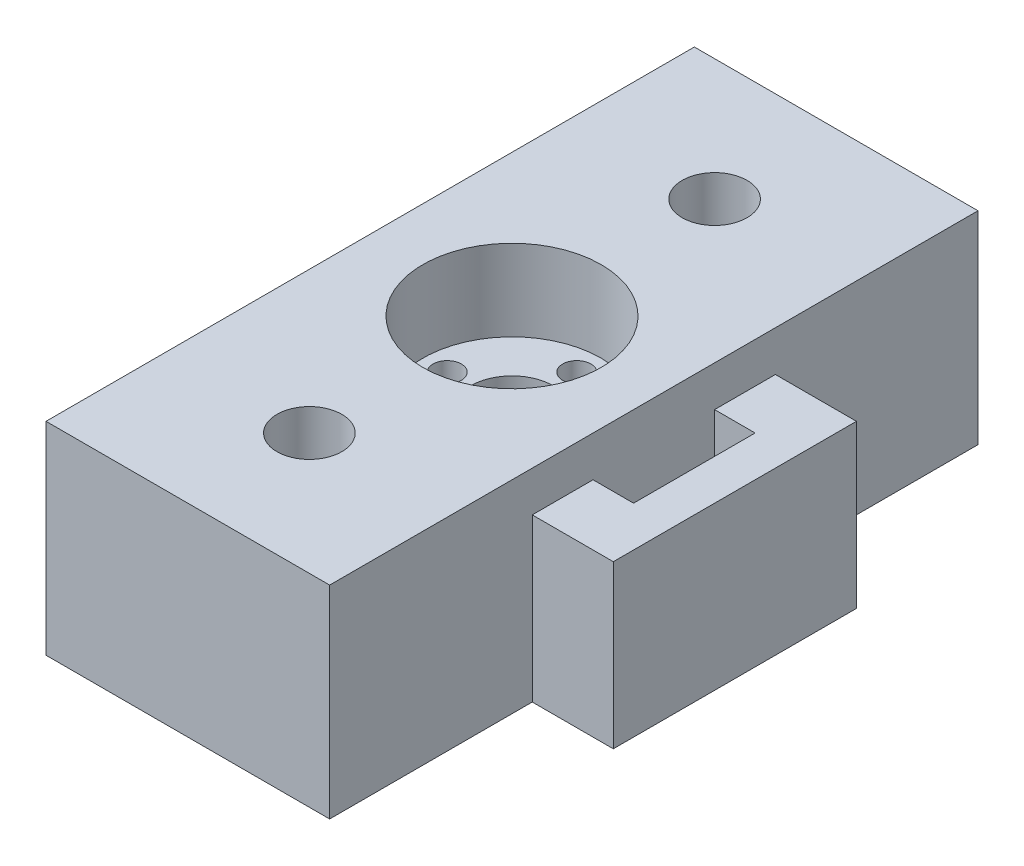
ISO-10303-21;
HEADER;
FILE_DESCRIPTION(('STEP AP214'),'2;1');
FILE_NAME('part.step','',(''),(''),'','','');
FILE_SCHEMA(('AUTOMOTIVE_DESIGN { 1 0 10303 214 1 1 1 1 }'));
ENDSEC;
DATA;
#1=APPLICATION_CONTEXT('core data for automotive mechanical design processes');
#2=APPLICATION_PROTOCOL_DEFINITION('international standard','automotive_design',2000,#1);
#3=PRODUCT_CONTEXT('',#1,'mechanical');
#4=PRODUCT('Part','Part','',(#3));
#5=PRODUCT_RELATED_PRODUCT_CATEGORY('part','',(#4));
#6=PRODUCT_DEFINITION_FORMATION('','',#4);
#7=PRODUCT_DEFINITION_CONTEXT('part definition',#1,'design');
#8=PRODUCT_DEFINITION('design','',#6,#7);
#9=PRODUCT_DEFINITION_SHAPE('','',#8);
#10=(LENGTH_UNIT() NAMED_UNIT(*) SI_UNIT(.MILLI.,.METRE.));
#11=(NAMED_UNIT(*) PLANE_ANGLE_UNIT() SI_UNIT($,.RADIAN.));
#12=(NAMED_UNIT(*) SI_UNIT($,.STERADIAN.) SOLID_ANGLE_UNIT());
#13=UNCERTAINTY_MEASURE_WITH_UNIT(LENGTH_MEASURE(1.E-05),#10,'distance_accuracy_value','');
#14=(GEOMETRIC_REPRESENTATION_CONTEXT(3) GLOBAL_UNCERTAINTY_ASSIGNED_CONTEXT((#13)) GLOBAL_UNIT_ASSIGNED_CONTEXT((#10,
#11,#12)) REPRESENTATION_CONTEXT('',''));
#15=CARTESIAN_POINT('',(0.,0.,0.));
#16=DIRECTION('',(0.,0.,1.));
#17=DIRECTION('',(1.,0.,0.));
#18=AXIS2_PLACEMENT_3D('',#15,#16,#17);
#19=CARTESIAN_POINT('',(35.,0.,0.));
#20=DIRECTION('',(1.,0.,0.));
#21=DIRECTION('',(0.,0.,-1.));
#22=AXIS2_PLACEMENT_3D('',#19,#20,#21);
#23=PLANE('',#22);
#24=DIRECTION('',(0.,0.,-1.));
#25=VECTOR('',#24,1.);
#26=CARTESIAN_POINT('',(35.,0.,80.));
#27=LINE('',#26,#25);
#28=CARTESIAN_POINT('',(35.,0.,47.5));
#29=VERTEX_POINT('',#28);
#30=CARTESIAN_POINT('',(35.,0.,32.5));
#31=VERTEX_POINT('',#30);
#32=EDGE_CURVE('E279',#29,#31,#27,.T.);
#33=ORIENTED_EDGE('',*,*,#32,.T.);
#34=DIRECTION('',(0.,-1.,0.));
#35=VECTOR('',#34,1.);
#36=CARTESIAN_POINT('',(35.,0.,32.5));
#37=LINE('',#36,#35);
#38=CARTESIAN_POINT('',(35.,20.,32.5));
#39=VERTEX_POINT('',#38);
#40=EDGE_CURVE('E333',#39,#31,#37,.T.);
#41=ORIENTED_EDGE('',*,*,#40,.F.);
#42=DIRECTION('',(0.,0.,-1.));
#43=VECTOR('',#42,1.);
#44=CARTESIAN_POINT('',(35.,20.,0.));
#45=LINE('',#44,#43);
#46=CARTESIAN_POINT('',(35.,20.,25.));
#47=VERTEX_POINT('',#46);
#48=EDGE_CURVE('E157',#39,#47,#45,.T.);
#49=ORIENTED_EDGE('',*,*,#48,.T.);
#50=DIRECTION('',(0.,1.,0.));
#51=VECTOR('',#50,1.);
#52=CARTESIAN_POINT('',(35.,0.,25.));
#53=LINE('',#52,#51);
#54=CARTESIAN_POINT('',(35.,0.,25.));
#55=VERTEX_POINT('',#54);
#56=EDGE_CURVE('E327',#55,#47,#53,.T.);
#57=ORIENTED_EDGE('',*,*,#56,.F.);
#58=CARTESIAN_POINT('',(35.,0.,0.));
#59=VERTEX_POINT('',#58);
#60=EDGE_CURVE('E272',#55,#59,#27,.T.);
#61=ORIENTED_EDGE('',*,*,#60,.T.);
#62=DIRECTION('',(0.,1.,0.));
#63=VECTOR('',#62,1.);
#64=CARTESIAN_POINT('',(35.,25.,0.));
#65=LINE('',#64,#63);
#66=CARTESIAN_POINT('',(35.,25.,0.));
#67=VERTEX_POINT('',#66);
#68=EDGE_CURVE('E278',#59,#67,#65,.T.);
#69=ORIENTED_EDGE('',*,*,#68,.T.);
#70=DIRECTION('',(0.,0.,1.));
#71=VECTOR('',#70,1.);
#72=CARTESIAN_POINT('',(35.,25.,80.));
#73=LINE('',#72,#71);
#74=CARTESIAN_POINT('',(35.,25.,80.));
#75=VERTEX_POINT('',#74);
#76=EDGE_CURVE('E282',#67,#75,#73,.T.);
#77=ORIENTED_EDGE('',*,*,#76,.T.);
#78=DIRECTION('',(0.,-1.,0.));
#79=VECTOR('',#78,1.);
#80=CARTESIAN_POINT('',(35.,25.,80.));
#81=LINE('',#80,#79);
#82=CARTESIAN_POINT('',(35.,0.,80.));
#83=VERTEX_POINT('',#82);
#84=EDGE_CURVE('E268',#75,#83,#81,.T.);
#85=ORIENTED_EDGE('',*,*,#84,.T.);
#86=CARTESIAN_POINT('',(35.,0.,55.));
#87=VERTEX_POINT('',#86);
#88=EDGE_CURVE('E274',#83,#87,#27,.T.);
#89=ORIENTED_EDGE('',*,*,#88,.T.);
#90=DIRECTION('',(0.,1.,0.));
#91=VECTOR('',#90,1.);
#92=CARTESIAN_POINT('',(35.,0.,55.));
#93=LINE('',#92,#91);
#94=CARTESIAN_POINT('',(35.,20.,55.));
#95=VERTEX_POINT('',#94);
#96=EDGE_CURVE('E179',#87,#95,#93,.T.);
#97=ORIENTED_EDGE('',*,*,#96,.T.);
#98=DIRECTION('',(0.,0.,-1.));
#99=VECTOR('',#98,1.);
#100=CARTESIAN_POINT('',(35.,20.,0.));
#101=LINE('',#100,#99);
#102=CARTESIAN_POINT('',(35.,20.,47.5));
#103=VERTEX_POINT('',#102);
#104=EDGE_CURVE('E169',#95,#103,#101,.T.);
#105=ORIENTED_EDGE('',*,*,#104,.T.);
#106=DIRECTION('',(0.,-1.,0.));
#107=VECTOR('',#106,1.);
#108=CARTESIAN_POINT('',(35.,0.,47.5));
#109=LINE('',#108,#107);
#110=EDGE_CURVE('E164',#103,#29,#109,.T.);
#111=ORIENTED_EDGE('',*,*,#110,.T.);
#112=EDGE_LOOP('',(#33,#41,#49,#57,#61,#69,#77,#85,#89,#97,#105,#111));
#113=FACE_BOUND('',#112,.T.);
#114=ADVANCED_FACE('F52',(#113),#23,.T.);
#115=CARTESIAN_POINT('',(35.,25.,80.));
#116=DIRECTION('',(0.,0.,-1.));
#117=DIRECTION('',(-1.,0.,0.));
#118=AXIS2_PLACEMENT_3D('',#115,#116,#117);
#119=PLANE('',#118);
#120=DIRECTION('',(0.,-1.,0.));
#121=VECTOR('',#120,1.);
#122=CARTESIAN_POINT('',(0.,25.,80.));
#123=LINE('',#122,#121);
#124=CARTESIAN_POINT('',(0.,25.,80.));
#125=VERTEX_POINT('',#124);
#126=CARTESIAN_POINT('',(0.,0.,80.));
#127=VERTEX_POINT('',#126);
#128=EDGE_CURVE('E264',#125,#127,#123,.T.);
#129=ORIENTED_EDGE('',*,*,#128,.T.);
#130=DIRECTION('',(-1.,0.,0.));
#131=VECTOR('',#130,1.);
#132=CARTESIAN_POINT('',(35.,0.,80.));
#133=LINE('',#132,#131);
#134=EDGE_CURVE('E12',#83,#127,#133,.T.);
#135=ORIENTED_EDGE('',*,*,#134,.F.);
#136=ORIENTED_EDGE('',*,*,#84,.F.);
#137=DIRECTION('',(-1.,0.,0.));
#138=VECTOR('',#137,1.);
#139=CARTESIAN_POINT('',(35.,25.,80.));
#140=LINE('',#139,#138);
#141=EDGE_CURVE('E285',#75,#125,#140,.T.);
#142=ORIENTED_EDGE('',*,*,#141,.T.);
#143=EDGE_LOOP('',(#129,#135,#136,#142));
#144=FACE_BOUND('',#143,.T.);
#145=ADVANCED_FACE('F54',(#144),#119,.F.);
#146=CARTESIAN_POINT('',(35.,0.,80.));
#147=DIRECTION('',(0.,1.,0.));
#148=DIRECTION('',(0.,0.,1.));
#149=AXIS2_PLACEMENT_3D('',#146,#147,#148);
#150=PLANE('',#149);
#151=DIRECTION('',(-1.,0.,0.));
#152=VECTOR('',#151,1.);
#153=CARTESIAN_POINT('',(45.,0.,47.5));
#154=LINE('',#153,#152);
#155=CARTESIAN_POINT('',(40.,0.,47.5));
#156=VERTEX_POINT('',#155);
#157=EDGE_CURVE('E185',#156,#29,#154,.T.);
#158=ORIENTED_EDGE('',*,*,#157,.F.);
#159=DIRECTION('',(0.,0.,1.));
#160=VECTOR('',#159,1.);
#161=CARTESIAN_POINT('',(40.,0.,0.));
#162=LINE('',#161,#160);
#163=CARTESIAN_POINT('',(40.,0.,32.5));
#164=VERTEX_POINT('',#163);
#165=EDGE_CURVE('E363',#164,#156,#162,.T.);
#166=ORIENTED_EDGE('',*,*,#165,.F.);
#167=DIRECTION('',(-1.,0.,0.));
#168=VECTOR('',#167,1.);
#169=CARTESIAN_POINT('',(45.,0.,32.5));
#170=LINE('',#169,#168);
#171=EDGE_CURVE('E155',#164,#31,#170,.T.);
#172=ORIENTED_EDGE('',*,*,#171,.T.);
#173=ORIENTED_EDGE('',*,*,#32,.F.);
#174=EDGE_LOOP('',(#158,#166,#172,#173));
#175=FACE_BOUND('',#174,.T.);
#176=CARTESIAN_POINT('',(17.5,0.,15.));
#177=DIRECTION('',(0.,1.,0.));
#178=DIRECTION('',(0.,0.,1.));
#179=AXIS2_PLACEMENT_3D('',#176,#177,#178);
#180=CIRCLE('',#179,4.);
#181=CARTESIAN_POINT('',(17.5,0.,19.));
#182=VERTEX_POINT('',#181);
#183=EDGE_CURVE('E236',#182,#182,#180,.T.);
#184=ORIENTED_EDGE('',*,*,#183,.T.);
#185=EDGE_LOOP('',(#184));
#186=FACE_BOUND('',#185,.T.);
#187=CARTESIAN_POINT('',(17.5,0.,65.));
#188=DIRECTION('',(0.,1.,0.));
#189=DIRECTION('',(0.,0.,1.));
#190=AXIS2_PLACEMENT_3D('',#187,#188,#189);
#191=CIRCLE('',#190,4.);
#192=CARTESIAN_POINT('',(17.5,0.,69.));
#193=VERTEX_POINT('',#192);
#194=EDGE_CURVE('E208',#193,#193,#191,.T.);
#195=ORIENTED_EDGE('',*,*,#194,.T.);
#196=EDGE_LOOP('',(#195));
#197=FACE_BOUND('',#196,.T.);
#198=CARTESIAN_POINT('',(17.5,0.,40.));
#199=DIRECTION('',(0.,1.,0.));
#200=DIRECTION('',(0.,0.,1.));
#201=AXIS2_PLACEMENT_3D('',#198,#199,#200);
#202=CIRCLE('',#201,5.1);
#203=CARTESIAN_POINT('',(17.5,0.,45.1));
#204=VERTEX_POINT('',#203);
#205=EDGE_CURVE('E240',#204,#204,#202,.T.);
#206=ORIENTED_EDGE('',*,*,#205,.T.);
#207=EDGE_LOOP('',(#206));
#208=FACE_BOUND('',#207,.T.);
#209=DIRECTION('',(0.,0.,-1.));
#210=VECTOR('',#209,1.);
#211=CARTESIAN_POINT('',(0.,0.,80.));
#212=LINE('',#211,#210);
#213=CARTESIAN_POINT('',(0.,0.,0.));
#214=VERTEX_POINT('',#213);
#215=EDGE_CURVE('E289',#127,#214,#212,.T.);
#216=ORIENTED_EDGE('',*,*,#215,.T.);
#217=DIRECTION('',(-1.,0.,0.));
#218=VECTOR('',#217,1.);
#219=CARTESIAN_POINT('',(35.,0.,0.));
#220=LINE('',#219,#218);
#221=EDGE_CURVE('E61',#59,#214,#220,.T.);
#222=ORIENTED_EDGE('',*,*,#221,.F.);
#223=ORIENTED_EDGE('',*,*,#60,.F.);
#224=DIRECTION('',(-1.,0.,0.));
#225=VECTOR('',#224,1.);
#226=CARTESIAN_POINT('',(45.,0.,25.));
#227=LINE('',#226,#225);
#228=CARTESIAN_POINT('',(45.,0.,25.));
#229=VERTEX_POINT('',#228);
#230=EDGE_CURVE('E171',#229,#55,#227,.T.);
#231=ORIENTED_EDGE('',*,*,#230,.F.);
#232=DIRECTION('',(0.,0.,-1.));
#233=VECTOR('',#232,1.);
#234=CARTESIAN_POINT('',(45.,0.,0.));
#235=LINE('',#234,#233);
#236=CARTESIAN_POINT('',(45.,0.,55.));
#237=VERTEX_POINT('',#236);
#238=EDGE_CURVE('E183',#237,#229,#235,.T.);
#239=ORIENTED_EDGE('',*,*,#238,.F.);
#240=DIRECTION('',(-1.,0.,0.));
#241=VECTOR('',#240,1.);
#242=CARTESIAN_POINT('',(45.,0.,55.));
#243=LINE('',#242,#241);
#244=EDGE_CURVE('E195',#237,#87,#243,.T.);
#245=ORIENTED_EDGE('',*,*,#244,.T.);
#246=ORIENTED_EDGE('',*,*,#88,.F.);
#247=ORIENTED_EDGE('',*,*,#134,.T.);
#248=EDGE_LOOP('',(#216,#222,#223,#231,#239,#245,#246,#247));
#249=FACE_BOUND('',#248,.T.);
#250=ADVANCED_FACE('F353',(#175,#186,#197,#208,#249),#150,.F.);
#251=CARTESIAN_POINT('',(35.,25.,0.));
#252=DIRECTION('',(0.,0.,1.));
#253=DIRECTION('',(0.,-1.,0.));
#254=AXIS2_PLACEMENT_3D('',#251,#252,#253);
#255=PLANE('',#254);
#256=DIRECTION('',(0.,1.,0.));
#257=VECTOR('',#256,1.);
#258=CARTESIAN_POINT('',(0.,25.,0.));
#259=LINE('',#258,#257);
#260=CARTESIAN_POINT('',(0.,25.,0.));
#261=VERTEX_POINT('',#260);
#262=EDGE_CURVE('E292',#214,#261,#259,.T.);
#263=ORIENTED_EDGE('',*,*,#262,.T.);
#264=DIRECTION('',(-1.,0.,0.));
#265=VECTOR('',#264,1.);
#266=CARTESIAN_POINT('',(35.,25.,0.));
#267=LINE('',#266,#265);
#268=EDGE_CURVE('E300',#67,#261,#267,.T.);
#269=ORIENTED_EDGE('',*,*,#268,.F.);
#270=ORIENTED_EDGE('',*,*,#68,.F.);
#271=ORIENTED_EDGE('',*,*,#221,.T.);
#272=EDGE_LOOP('',(#263,#269,#270,#271));
#273=FACE_BOUND('',#272,.T.);
#274=ADVANCED_FACE('F309',(#273),#255,.F.);
#275=CARTESIAN_POINT('',(35.,25.,80.));
#276=DIRECTION('',(0.,-1.,0.));
#277=DIRECTION('',(0.,0.,-1.));
#278=AXIS2_PLACEMENT_3D('',#275,#276,#277);
#279=PLANE('',#278);
#280=CARTESIAN_POINT('',(17.5,25.,15.));
#281=DIRECTION('',(0.,1.,0.));
#282=DIRECTION('',(0.,0.,1.));
#283=AXIS2_PLACEMENT_3D('',#280,#281,#282);
#284=CIRCLE('',#283,4.);
#285=CARTESIAN_POINT('',(17.5,25.,19.));
#286=VERTEX_POINT('',#285);
#287=EDGE_CURVE('E241',#286,#286,#284,.T.);
#288=ORIENTED_EDGE('',*,*,#287,.F.);
#289=EDGE_LOOP('',(#288));
#290=FACE_BOUND('',#289,.T.);
#291=CARTESIAN_POINT('',(17.5,25.,65.));
#292=DIRECTION('',(0.,1.,0.));
#293=DIRECTION('',(0.,0.,1.));
#294=AXIS2_PLACEMENT_3D('',#291,#292,#293);
#295=CIRCLE('',#294,4.);
#296=CARTESIAN_POINT('',(17.5,25.,69.));
#297=VERTEX_POINT('',#296);
#298=EDGE_CURVE('E245',#297,#297,#295,.T.);
#299=ORIENTED_EDGE('',*,*,#298,.F.);
#300=EDGE_LOOP('',(#299));
#301=FACE_BOUND('',#300,.T.);
#302=CARTESIAN_POINT('',(17.5,25.,40.));
#303=DIRECTION('',(0.,-1.,0.));
#304=DIRECTION('',(0.,0.,-1.));
#305=AXIS2_PLACEMENT_3D('',#302,#303,#304);
#306=CIRCLE('',#305,11.);
#307=CARTESIAN_POINT('',(17.5,25.,29.));
#308=VERTEX_POINT('',#307);
#309=EDGE_CURVE('E259',#308,#308,#306,.T.);
#310=ORIENTED_EDGE('',*,*,#309,.T.);
#311=EDGE_LOOP('',(#310));
#312=FACE_BOUND('',#311,.T.);
#313=DIRECTION('',(0.,0.,1.));
#314=VECTOR('',#313,1.);
#315=CARTESIAN_POINT('',(0.,25.,80.));
#316=LINE('',#315,#314);
#317=EDGE_CURVE('E273',#261,#125,#316,.T.);
#318=ORIENTED_EDGE('',*,*,#317,.T.);
#319=ORIENTED_EDGE('',*,*,#141,.F.);
#320=ORIENTED_EDGE('',*,*,#76,.F.);
#321=ORIENTED_EDGE('',*,*,#268,.T.);
#322=EDGE_LOOP('',(#318,#319,#320,#321));
#323=FACE_BOUND('',#322,.T.);
#324=ADVANCED_FACE('F318',(#290,#301,#312,#323),#279,.F.);
#325=CARTESIAN_POINT('',(0.,0.,0.));
#326=DIRECTION('',(1.,0.,0.));
#327=DIRECTION('',(0.,0.,-1.));
#328=AXIS2_PLACEMENT_3D('',#325,#326,#327);
#329=PLANE('',#328);
#330=ORIENTED_EDGE('',*,*,#128,.F.);
#331=ORIENTED_EDGE('',*,*,#317,.F.);
#332=ORIENTED_EDGE('',*,*,#262,.F.);
#333=ORIENTED_EDGE('',*,*,#215,.F.);
#334=EDGE_LOOP('',(#330,#331,#332,#333));
#335=FACE_BOUND('',#334,.T.);
#336=ADVANCED_FACE('F315',(#335),#329,.F.);
#337=CARTESIAN_POINT('',(17.5,15.,40.));
#338=DIRECTION('',(0.,-1.,0.));
#339=DIRECTION('',(0.,0.,-1.));
#340=AXIS2_PLACEMENT_3D('',#337,#338,#339);
#341=PLANE('',#340);
#342=CARTESIAN_POINT('',(17.5,15.,32.));
#343=DIRECTION('',(0.,1.,0.));
#344=DIRECTION('',(0.,0.,1.));
#345=AXIS2_PLACEMENT_3D('',#342,#343,#344);
#346=CIRCLE('',#345,1.75);
#347=CARTESIAN_POINT('',(17.5,15.,33.75));
#348=VERTEX_POINT('',#347);
#349=EDGE_CURVE('E209',#348,#348,#346,.T.);
#350=ORIENTED_EDGE('',*,*,#349,.F.);
#351=EDGE_LOOP('',(#350));
#352=FACE_BOUND('',#351,.T.);
#353=CARTESIAN_POINT('',(25.5,15.,40.));
#354=DIRECTION('',(0.,1.,0.));
#355=DIRECTION('',(0.,0.,1.));
#356=AXIS2_PLACEMENT_3D('',#353,#354,#355);
#357=CIRCLE('',#356,1.75);
#358=CARTESIAN_POINT('',(25.5,15.,41.75));
#359=VERTEX_POINT('',#358);
#360=EDGE_CURVE('E213',#359,#359,#357,.T.);
#361=ORIENTED_EDGE('',*,*,#360,.F.);
#362=EDGE_LOOP('',(#361));
#363=FACE_BOUND('',#362,.T.);
#364=CARTESIAN_POINT('',(17.5,15.,48.));
#365=DIRECTION('',(0.,1.,0.));
#366=DIRECTION('',(0.,0.,1.));
#367=AXIS2_PLACEMENT_3D('',#364,#365,#366);
#368=CIRCLE('',#367,1.75);
#369=CARTESIAN_POINT('',(17.5,15.,49.75));
#370=VERTEX_POINT('',#369);
#371=EDGE_CURVE('E221',#370,#370,#368,.T.);
#372=ORIENTED_EDGE('',*,*,#371,.F.);
#373=EDGE_LOOP('',(#372));
#374=FACE_BOUND('',#373,.T.);
#375=CARTESIAN_POINT('',(9.5,15.,40.));
#376=DIRECTION('',(0.,1.,0.));
#377=DIRECTION('',(0.,0.,1.));
#378=AXIS2_PLACEMENT_3D('',#375,#376,#377);
#379=CIRCLE('',#378,1.75);
#380=CARTESIAN_POINT('',(9.5,15.,41.75));
#381=VERTEX_POINT('',#380);
#382=EDGE_CURVE('E229',#381,#381,#379,.T.);
#383=ORIENTED_EDGE('',*,*,#382,.F.);
#384=EDGE_LOOP('',(#383));
#385=FACE_BOUND('',#384,.T.);
#386=CARTESIAN_POINT('',(17.5,15.,40.));
#387=DIRECTION('',(0.,-1.,0.));
#388=DIRECTION('',(0.,0.,-1.));
#389=AXIS2_PLACEMENT_3D('',#386,#387,#388);
#390=CIRCLE('',#389,11.);
#391=CARTESIAN_POINT('',(17.5,15.,29.));
#392=VERTEX_POINT('',#391);
#393=EDGE_CURVE('E260',#392,#392,#390,.T.);
#394=ORIENTED_EDGE('',*,*,#393,.F.);
#395=EDGE_LOOP('',(#394));
#396=FACE_BOUND('',#395,.T.);
#397=CARTESIAN_POINT('',(17.5,15.,40.));
#398=DIRECTION('',(0.,-1.,0.));
#399=DIRECTION('',(0.,0.,-1.));
#400=AXIS2_PLACEMENT_3D('',#397,#398,#399);
#401=CIRCLE('',#400,5.1);
#402=CARTESIAN_POINT('',(17.5,15.,45.1));
#403=VERTEX_POINT('',#402);
#404=EDGE_CURVE('E255',#403,#403,#401,.T.);
#405=ORIENTED_EDGE('',*,*,#404,.T.);
#406=EDGE_LOOP('',(#405));
#407=FACE_BOUND('',#406,.T.);
#408=ADVANCED_FACE('F384',(#352,#363,#374,#385,#396,#407),#341,.F.);
#409=CARTESIAN_POINT('',(17.5,15.,40.));
#410=DIRECTION('',(0.,1.,0.));
#411=DIRECTION('',(0.,0.,1.));
#412=AXIS2_PLACEMENT_3D('',#409,#410,#411);
#413=CYLINDRICAL_SURFACE('',#412,11.);
#414=ORIENTED_EDGE('',*,*,#393,.T.);
#415=EDGE_LOOP('',(#414));
#416=FACE_BOUND('',#415,.T.);
#417=ORIENTED_EDGE('',*,*,#309,.F.);
#418=EDGE_LOOP('',(#417));
#419=FACE_BOUND('',#418,.T.);
#420=ADVANCED_FACE('F380',(#416,#419),#413,.F.);
#421=CARTESIAN_POINT('',(17.5,0.,40.));
#422=DIRECTION('',(0.,1.,0.));
#423=DIRECTION('',(0.,0.,1.));
#424=AXIS2_PLACEMENT_3D('',#421,#422,#423);
#425=CYLINDRICAL_SURFACE('',#424,5.1);
#426=CARTESIAN_POINT('',(17.5,0.,45.1));
#427=CARTESIAN_POINT('',(17.5,0.156250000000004,45.1));
#428=CARTESIAN_POINT('',(17.5,0.312500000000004,45.1));
#429=CARTESIAN_POINT('',(17.5,0.625000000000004,45.1));
#430=CARTESIAN_POINT('',(17.5,0.781250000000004,45.1));
#431=CARTESIAN_POINT('',(17.5,1.09375,45.1));
#432=CARTESIAN_POINT('',(17.5,1.25,45.1));
#433=CARTESIAN_POINT('',(17.5,1.5625,45.1));
#434=CARTESIAN_POINT('',(17.5,1.71875,45.1));
#435=CARTESIAN_POINT('',(17.5,2.03125,45.1));
#436=CARTESIAN_POINT('',(17.5,2.1875,45.1));
#437=CARTESIAN_POINT('',(17.5,2.50000000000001,45.1));
#438=CARTESIAN_POINT('',(17.5,2.65625000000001,45.1));
#439=CARTESIAN_POINT('',(17.5,2.96875000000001,45.1));
#440=CARTESIAN_POINT('',(17.5,3.12500000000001,45.1));
#441=CARTESIAN_POINT('',(17.5,3.43750000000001,45.1));
#442=CARTESIAN_POINT('',(17.5,3.59375000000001,45.1));
#443=CARTESIAN_POINT('',(17.5,3.90625000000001,45.1));
#444=CARTESIAN_POINT('',(17.5,4.06250000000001,45.1));
#445=CARTESIAN_POINT('',(17.5,4.37500000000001,45.1));
#446=CARTESIAN_POINT('',(17.5,4.53125000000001,45.1));
#447=CARTESIAN_POINT('',(17.5,4.84375000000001,45.1));
#448=CARTESIAN_POINT('',(17.5,5.00000000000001,45.1));
#449=CARTESIAN_POINT('',(17.5,5.31250000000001,45.1));
#450=CARTESIAN_POINT('',(17.5,5.46875000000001,45.1));
#451=CARTESIAN_POINT('',(17.5,5.78125000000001,45.1));
#452=CARTESIAN_POINT('',(17.5,5.93750000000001,45.1));
#453=CARTESIAN_POINT('',(17.5,6.25000000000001,45.1));
#454=CARTESIAN_POINT('',(17.5,6.40625000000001,45.1));
#455=CARTESIAN_POINT('',(17.5,6.71875000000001,45.1));
#456=CARTESIAN_POINT('',(17.5,6.87500000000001,45.1));
#457=CARTESIAN_POINT('',(17.5,7.18750000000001,45.1));
#458=CARTESIAN_POINT('',(17.5,7.34375000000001,45.1));
#459=CARTESIAN_POINT('',(17.5,7.65625000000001,45.1));
#460=CARTESIAN_POINT('',(17.5,7.81250000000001,45.1));
#461=CARTESIAN_POINT('',(17.5,8.12500000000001,45.1));
#462=CARTESIAN_POINT('',(17.5,8.28125000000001,45.1));
#463=CARTESIAN_POINT('',(17.5,8.59375000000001,45.1));
#464=CARTESIAN_POINT('',(17.5,8.75000000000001,45.1));
#465=CARTESIAN_POINT('',(17.5,9.06250000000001,45.1));
#466=CARTESIAN_POINT('',(17.5,9.21875000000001,45.1));
#467=CARTESIAN_POINT('',(17.5,9.53125000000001,45.1));
#468=CARTESIAN_POINT('',(17.5,9.68750000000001,45.1));
#469=CARTESIAN_POINT('',(17.5,10.,45.1));
#470=CARTESIAN_POINT('',(17.5,10.15625,45.1));
#471=CARTESIAN_POINT('',(17.5,10.46875,45.1));
#472=CARTESIAN_POINT('',(17.5,10.625,45.1));
#473=CARTESIAN_POINT('',(17.5,10.9375,45.1));
#474=CARTESIAN_POINT('',(17.5,11.09375,45.1));
#475=CARTESIAN_POINT('',(17.5,11.40625,45.1));
#476=CARTESIAN_POINT('',(17.5,11.5625,45.1));
#477=CARTESIAN_POINT('',(17.5,11.875,45.1));
#478=CARTESIAN_POINT('',(17.5,12.03125,45.1));
#479=CARTESIAN_POINT('',(17.5,12.34375,45.1));
#480=CARTESIAN_POINT('',(17.5,12.5,45.1));
#481=CARTESIAN_POINT('',(17.5,12.8125,45.1));
#482=CARTESIAN_POINT('',(17.5,12.96875,45.1));
#483=CARTESIAN_POINT('',(17.5,13.28125,45.1));
#484=CARTESIAN_POINT('',(17.5,13.4375,45.1));
#485=CARTESIAN_POINT('',(17.5,13.75,45.1));
#486=CARTESIAN_POINT('',(17.5,13.90625,45.1));
#487=CARTESIAN_POINT('',(17.5,14.21875,45.1));
#488=CARTESIAN_POINT('',(17.5,14.375,45.1));
#489=CARTESIAN_POINT('',(17.5,14.6875,45.1));
#490=CARTESIAN_POINT('',(17.5,14.84375,45.1));
#491=CARTESIAN_POINT('',(17.5,15.,45.1));
#492=B_SPLINE_CURVE_WITH_KNOTS('',3,(#426,#427,#428,#429,#430,#431,#432,#433,#434,#435,#436,
#437,#438,#439,#440,#441,#442,#443,#444,#445,#446,#447,#448,#449,#450,#451,#452,#453,#454,#455,
#456,#457,#458,#459,#460,#461,#462,#463,#464,#465,#466,#467,#468,#469,#470,#471,#472,#473,#474,
#475,#476,#477,#478,#479,#480,#481,#482,#483,#484,#485,#486,#487,#488,#489,#490,#491),
.UNSPECIFIED.,.F.,.F.,(4,2,2,2,2,2,2,2,2,2,2,2,2,2,2,2,2,2,2,2,2,2,2,2,2,2,2,2,2,2,2,2,4),(0.,
0.46875,0.937500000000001,1.40625,1.875,2.34375,2.8125,3.28125,3.75,4.21875,4.6875,5.15625,
5.625,6.09375,6.56250000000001,7.03125000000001,7.50000000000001,7.96875000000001,
8.43750000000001,8.90625000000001,9.37500000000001,9.84375000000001,10.3125,10.78125,11.25,
11.71875,12.1875,12.65625,13.125,13.59375,14.0625,14.53125,15.),.UNSPECIFIED.);
#493=EDGE_CURVE('BSEAM376',#204,#403,#492,.T.);
#494=ORIENTED_EDGE('',*,*,#205,.F.);
#495=ORIENTED_EDGE('',*,*,#404,.F.);
#496=ORIENTED_EDGE('',*,*,#493,.T.);
#497=ORIENTED_EDGE('',*,*,#493,.F.);
#498=EDGE_LOOP('',(#494,#496,#495,#497));
#499=FACE_BOUND('',#498,.T.);
#500=ADVANCED_FACE('F376',(#499),#425,.F.);
#501=CARTESIAN_POINT('',(17.5,0.,65.));
#502=DIRECTION('',(0.,1.,0.));
#503=DIRECTION('',(0.,0.,1.));
#504=AXIS2_PLACEMENT_3D('',#501,#502,#503);
#505=CYLINDRICAL_SURFACE('',#504,4.);
#506=CARTESIAN_POINT('',(17.5,0.,69.));
#507=CARTESIAN_POINT('',(17.5,0.26041666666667,69.));
#508=CARTESIAN_POINT('',(17.5,0.520833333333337,69.));
#509=CARTESIAN_POINT('',(17.5,1.04166666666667,69.));
#510=CARTESIAN_POINT('',(17.5,1.30208333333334,69.));
#511=CARTESIAN_POINT('',(17.5,1.82291666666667,69.));
#512=CARTESIAN_POINT('',(17.5,2.08333333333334,69.));
#513=CARTESIAN_POINT('',(17.5,2.60416666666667,69.));
#514=CARTESIAN_POINT('',(17.5,2.86458333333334,69.));
#515=CARTESIAN_POINT('',(17.5,3.38541666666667,69.));
#516=CARTESIAN_POINT('',(17.5,3.64583333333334,69.));
#517=CARTESIAN_POINT('',(17.5,4.16666666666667,69.));
#518=CARTESIAN_POINT('',(17.5,4.42708333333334,69.));
#519=CARTESIAN_POINT('',(17.5,4.94791666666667,69.));
#520=CARTESIAN_POINT('',(17.5,5.20833333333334,69.));
#521=CARTESIAN_POINT('',(17.5,5.72916666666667,69.));
#522=CARTESIAN_POINT('',(17.5,5.98958333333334,69.));
#523=CARTESIAN_POINT('',(17.5,6.51041666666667,69.));
#524=CARTESIAN_POINT('',(17.5,6.77083333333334,69.));
#525=CARTESIAN_POINT('',(17.5,7.29166666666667,69.));
#526=CARTESIAN_POINT('',(17.5,7.55208333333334,69.));
#527=CARTESIAN_POINT('',(17.5,8.07291666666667,69.));
#528=CARTESIAN_POINT('',(17.5,8.33333333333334,69.));
#529=CARTESIAN_POINT('',(17.5,8.85416666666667,69.));
#530=CARTESIAN_POINT('',(17.5,9.11458333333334,69.));
#531=CARTESIAN_POINT('',(17.5,9.63541666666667,69.));
#532=CARTESIAN_POINT('',(17.5,9.89583333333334,69.));
#533=CARTESIAN_POINT('',(17.5,10.4166666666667,69.));
#534=CARTESIAN_POINT('',(17.5,10.6770833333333,69.));
#535=CARTESIAN_POINT('',(17.5,11.1979166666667,69.));
#536=CARTESIAN_POINT('',(17.5,11.4583333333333,69.));
#537=CARTESIAN_POINT('',(17.5,11.9791666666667,69.));
#538=CARTESIAN_POINT('',(17.5,12.2395833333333,69.));
#539=CARTESIAN_POINT('',(17.5,12.7604166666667,69.));
#540=CARTESIAN_POINT('',(17.5,13.0208333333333,69.));
#541=CARTESIAN_POINT('',(17.5,13.5416666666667,69.));
#542=CARTESIAN_POINT('',(17.5,13.8020833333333,69.));
#543=CARTESIAN_POINT('',(17.5,14.3229166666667,69.));
#544=CARTESIAN_POINT('',(17.5,14.5833333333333,69.));
#545=CARTESIAN_POINT('',(17.5,15.1041666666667,69.));
#546=CARTESIAN_POINT('',(17.5,15.3645833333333,69.));
#547=CARTESIAN_POINT('',(17.5,15.8854166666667,69.));
#548=CARTESIAN_POINT('',(17.5,16.1458333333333,69.));
#549=CARTESIAN_POINT('',(17.5,16.6666666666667,69.));
#550=CARTESIAN_POINT('',(17.5,16.9270833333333,69.));
#551=CARTESIAN_POINT('',(17.5,17.4479166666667,69.));
#552=CARTESIAN_POINT('',(17.5,17.7083333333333,69.));
#553=CARTESIAN_POINT('',(17.5,18.2291666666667,69.));
#554=CARTESIAN_POINT('',(17.5,18.4895833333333,69.));
#555=CARTESIAN_POINT('',(17.5,19.0104166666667,69.));
#556=CARTESIAN_POINT('',(17.5,19.2708333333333,69.));
#557=CARTESIAN_POINT('',(17.5,19.7916666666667,69.));
#558=CARTESIAN_POINT('',(17.5,20.0520833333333,69.));
#559=CARTESIAN_POINT('',(17.5,20.5729166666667,69.));
#560=CARTESIAN_POINT('',(17.5,20.8333333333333,69.));
#561=CARTESIAN_POINT('',(17.5,21.3541666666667,69.));
#562=CARTESIAN_POINT('',(17.5,21.6145833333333,69.));
#563=CARTESIAN_POINT('',(17.5,22.1354166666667,69.));
#564=CARTESIAN_POINT('',(17.5,22.3958333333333,69.));
#565=CARTESIAN_POINT('',(17.5,22.9166666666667,69.));
#566=CARTESIAN_POINT('',(17.5,23.1770833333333,69.));
#567=CARTESIAN_POINT('',(17.5,23.6979166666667,69.));
#568=CARTESIAN_POINT('',(17.5,23.9583333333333,69.));
#569=CARTESIAN_POINT('',(17.5,24.4791666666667,69.));
#570=CARTESIAN_POINT('',(17.5,24.7395833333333,69.));
#571=CARTESIAN_POINT('',(17.5,25.,69.));
#572=B_SPLINE_CURVE_WITH_KNOTS('',3,(#506,#507,#508,#509,#510,#511,#512,#513,#514,#515,#516,
#517,#518,#519,#520,#521,#522,#523,#524,#525,#526,#527,#528,#529,#530,#531,#532,#533,#534,#535,
#536,#537,#538,#539,#540,#541,#542,#543,#544,#545,#546,#547,#548,#549,#550,#551,#552,#553,#554,
#555,#556,#557,#558,#559,#560,#561,#562,#563,#564,#565,#566,#567,#568,#569,#570,#571),
.UNSPECIFIED.,.F.,.F.,(4,2,2,2,2,2,2,2,2,2,2,2,2,2,2,2,2,2,2,2,2,2,2,2,2,2,2,2,2,2,2,2,4),(0.,
0.78125,1.5625,2.34375,3.125,3.90625,4.6875,5.46875,6.25,7.03125,7.8125,8.59375,9.375,10.15625,
10.9375,11.71875,12.5,13.28125,14.0625,14.84375,15.625,16.40625,17.1875,17.96875,18.75,19.53125,
20.3125,21.09375,21.875,22.65625,23.4375,24.21875,25.),.UNSPECIFIED.);
#573=EDGE_CURVE('BSEAM379',#193,#297,#572,.T.);
#574=ORIENTED_EDGE('',*,*,#194,.F.);
#575=ORIENTED_EDGE('',*,*,#298,.T.);
#576=ORIENTED_EDGE('',*,*,#573,.T.);
#577=ORIENTED_EDGE('',*,*,#573,.F.);
#578=EDGE_LOOP('',(#574,#576,#575,#577));
#579=FACE_BOUND('',#578,.T.);
#580=ADVANCED_FACE('F379',(#579),#505,.F.);
#581=CARTESIAN_POINT('',(17.5,0.,15.));
#582=DIRECTION('',(0.,1.,0.));
#583=DIRECTION('',(0.,0.,1.));
#584=AXIS2_PLACEMENT_3D('',#581,#582,#583);
#585=CYLINDRICAL_SURFACE('',#584,4.);
#586=CARTESIAN_POINT('',(17.5,0.,19.));
#587=CARTESIAN_POINT('',(17.5,0.26041666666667,19.));
#588=CARTESIAN_POINT('',(17.5,0.520833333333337,19.));
#589=CARTESIAN_POINT('',(17.5,1.04166666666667,19.));
#590=CARTESIAN_POINT('',(17.5,1.30208333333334,19.));
#591=CARTESIAN_POINT('',(17.5,1.82291666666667,19.));
#592=CARTESIAN_POINT('',(17.5,2.08333333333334,19.));
#593=CARTESIAN_POINT('',(17.5,2.60416666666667,19.));
#594=CARTESIAN_POINT('',(17.5,2.86458333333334,19.));
#595=CARTESIAN_POINT('',(17.5,3.38541666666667,19.));
#596=CARTESIAN_POINT('',(17.5,3.64583333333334,19.));
#597=CARTESIAN_POINT('',(17.5,4.16666666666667,19.));
#598=CARTESIAN_POINT('',(17.5,4.42708333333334,19.));
#599=CARTESIAN_POINT('',(17.5,4.94791666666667,19.));
#600=CARTESIAN_POINT('',(17.5,5.20833333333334,19.));
#601=CARTESIAN_POINT('',(17.5,5.72916666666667,19.));
#602=CARTESIAN_POINT('',(17.5,5.98958333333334,19.));
#603=CARTESIAN_POINT('',(17.5,6.51041666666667,19.));
#604=CARTESIAN_POINT('',(17.5,6.77083333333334,19.));
#605=CARTESIAN_POINT('',(17.5,7.29166666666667,19.));
#606=CARTESIAN_POINT('',(17.5,7.55208333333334,19.));
#607=CARTESIAN_POINT('',(17.5,8.07291666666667,19.));
#608=CARTESIAN_POINT('',(17.5,8.33333333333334,19.));
#609=CARTESIAN_POINT('',(17.5,8.85416666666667,19.));
#610=CARTESIAN_POINT('',(17.5,9.11458333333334,19.));
#611=CARTESIAN_POINT('',(17.5,9.63541666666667,19.));
#612=CARTESIAN_POINT('',(17.5,9.89583333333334,19.));
#613=CARTESIAN_POINT('',(17.5,10.4166666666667,19.));
#614=CARTESIAN_POINT('',(17.5,10.6770833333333,19.));
#615=CARTESIAN_POINT('',(17.5,11.1979166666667,19.));
#616=CARTESIAN_POINT('',(17.5,11.4583333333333,19.));
#617=CARTESIAN_POINT('',(17.5,11.9791666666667,19.));
#618=CARTESIAN_POINT('',(17.5,12.2395833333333,19.));
#619=CARTESIAN_POINT('',(17.5,12.7604166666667,19.));
#620=CARTESIAN_POINT('',(17.5,13.0208333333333,19.));
#621=CARTESIAN_POINT('',(17.5,13.5416666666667,19.));
#622=CARTESIAN_POINT('',(17.5,13.8020833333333,19.));
#623=CARTESIAN_POINT('',(17.5,14.3229166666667,19.));
#624=CARTESIAN_POINT('',(17.5,14.5833333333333,19.));
#625=CARTESIAN_POINT('',(17.5,15.1041666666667,19.));
#626=CARTESIAN_POINT('',(17.5,15.3645833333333,19.));
#627=CARTESIAN_POINT('',(17.5,15.8854166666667,19.));
#628=CARTESIAN_POINT('',(17.5,16.1458333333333,19.));
#629=CARTESIAN_POINT('',(17.5,16.6666666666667,19.));
#630=CARTESIAN_POINT('',(17.5,16.9270833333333,19.));
#631=CARTESIAN_POINT('',(17.5,17.4479166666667,19.));
#632=CARTESIAN_POINT('',(17.5,17.7083333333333,19.));
#633=CARTESIAN_POINT('',(17.5,18.2291666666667,19.));
#634=CARTESIAN_POINT('',(17.5,18.4895833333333,19.));
#635=CARTESIAN_POINT('',(17.5,19.0104166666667,19.));
#636=CARTESIAN_POINT('',(17.5,19.2708333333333,19.));
#637=CARTESIAN_POINT('',(17.5,19.7916666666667,19.));
#638=CARTESIAN_POINT('',(17.5,20.0520833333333,19.));
#639=CARTESIAN_POINT('',(17.5,20.5729166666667,19.));
#640=CARTESIAN_POINT('',(17.5,20.8333333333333,19.));
#641=CARTESIAN_POINT('',(17.5,21.3541666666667,19.));
#642=CARTESIAN_POINT('',(17.5,21.6145833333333,19.));
#643=CARTESIAN_POINT('',(17.5,22.1354166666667,19.));
#644=CARTESIAN_POINT('',(17.5,22.3958333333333,19.));
#645=CARTESIAN_POINT('',(17.5,22.9166666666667,19.));
#646=CARTESIAN_POINT('',(17.5,23.1770833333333,19.));
#647=CARTESIAN_POINT('',(17.5,23.6979166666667,19.));
#648=CARTESIAN_POINT('',(17.5,23.9583333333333,19.));
#649=CARTESIAN_POINT('',(17.5,24.4791666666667,19.));
#650=CARTESIAN_POINT('',(17.5,24.7395833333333,19.));
#651=CARTESIAN_POINT('',(17.5,25.,19.));
#652=B_SPLINE_CURVE_WITH_KNOTS('',3,(#586,#587,#588,#589,#590,#591,#592,#593,#594,#595,#596,
#597,#598,#599,#600,#601,#602,#603,#604,#605,#606,#607,#608,#609,#610,#611,#612,#613,#614,#615,
#616,#617,#618,#619,#620,#621,#622,#623,#624,#625,#626,#627,#628,#629,#630,#631,#632,#633,#634,
#635,#636,#637,#638,#639,#640,#641,#642,#643,#644,#645,#646,#647,#648,#649,#650,#651),
.UNSPECIFIED.,.F.,.F.,(4,2,2,2,2,2,2,2,2,2,2,2,2,2,2,2,2,2,2,2,2,2,2,2,2,2,2,2,2,2,2,2,4),(0.,
0.78125,1.5625,2.34375,3.125,3.90625,4.6875,5.46875,6.25,7.03125,7.8125,8.59375,9.375,10.15625,
10.9375,11.71875,12.5,13.28125,14.0625,14.84375,15.625,16.40625,17.1875,17.96875,18.75,19.53125,
20.3125,21.09375,21.875,22.65625,23.4375,24.21875,25.),.UNSPECIFIED.);
#653=EDGE_CURVE('BSEAM445',#182,#286,#652,.T.);
#654=ORIENTED_EDGE('',*,*,#183,.F.);
#655=ORIENTED_EDGE('',*,*,#287,.T.);
#656=ORIENTED_EDGE('',*,*,#653,.T.);
#657=ORIENTED_EDGE('',*,*,#653,.F.);
#658=EDGE_LOOP('',(#654,#656,#655,#657));
#659=FACE_BOUND('',#658,.T.);
#660=ADVANCED_FACE('F445',(#659),#585,.F.);
#661=CARTESIAN_POINT('',(9.5,5.00000000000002,40.));
#662=DIRECTION('',(0.,1.,0.));
#663=DIRECTION('',(0.,0.,1.));
#664=AXIS2_PLACEMENT_3D('',#661,#662,#663);
#665=CYLINDRICAL_SURFACE('',#664,1.75);
#666=CARTESIAN_POINT('',(9.5,5.00000000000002,40.));
#667=DIRECTION('',(0.,1.,0.));
#668=DIRECTION('',(0.,0.,1.));
#669=AXIS2_PLACEMENT_3D('',#666,#667,#668);
#670=CIRCLE('',#669,1.75);
#671=CARTESIAN_POINT('',(9.5,5.00000000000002,41.75));
#672=VERTEX_POINT('',#671);
#673=EDGE_CURVE('E203',#672,#672,#670,.T.);
#674=ORIENTED_EDGE('',*,*,#673,.F.);
#675=EDGE_LOOP('',(#674));
#676=FACE_BOUND('',#675,.T.);
#677=ORIENTED_EDGE('',*,*,#382,.T.);
#678=EDGE_LOOP('',(#677));
#679=FACE_BOUND('',#678,.T.);
#680=ADVANCED_FACE('F452',(#676,#679),#665,.F.);
#681=CARTESIAN_POINT('',(9.5,5.00000000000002,40.));
#682=DIRECTION('',(0.,1.,0.));
#683=DIRECTION('',(0.,0.,1.));
#684=AXIS2_PLACEMENT_3D('',#681,#682,#683);
#685=PLANE('',#684);
#686=ORIENTED_EDGE('',*,*,#673,.T.);
#687=EDGE_LOOP('',(#686));
#688=FACE_BOUND('',#687,.T.);
#689=ADVANCED_FACE('F460',(#688),#685,.T.);
#690=CARTESIAN_POINT('',(17.5,5.00000000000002,48.));
#691=DIRECTION('',(0.,1.,0.));
#692=DIRECTION('',(0.,0.,1.));
#693=AXIS2_PLACEMENT_3D('',#690,#691,#692);
#694=CYLINDRICAL_SURFACE('',#693,1.75);
#695=CARTESIAN_POINT('',(17.5,5.00000000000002,48.));
#696=DIRECTION('',(0.,1.,0.));
#697=DIRECTION('',(0.,0.,1.));
#698=AXIS2_PLACEMENT_3D('',#695,#696,#697);
#699=CIRCLE('',#698,1.75);
#700=CARTESIAN_POINT('',(17.5,5.00000000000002,49.75));
#701=VERTEX_POINT('',#700);
#702=EDGE_CURVE('E225',#701,#701,#699,.T.);
#703=ORIENTED_EDGE('',*,*,#702,.F.);
#704=EDGE_LOOP('',(#703));
#705=FACE_BOUND('',#704,.T.);
#706=ORIENTED_EDGE('',*,*,#371,.T.);
#707=EDGE_LOOP('',(#706));
#708=FACE_BOUND('',#707,.T.);
#709=ADVANCED_FACE('F468',(#705,#708),#694,.F.);
#710=CARTESIAN_POINT('',(17.5,5.00000000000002,48.));
#711=DIRECTION('',(0.,1.,0.));
#712=DIRECTION('',(0.,0.,1.));
#713=AXIS2_PLACEMENT_3D('',#710,#711,#712);
#714=PLANE('',#713);
#715=ORIENTED_EDGE('',*,*,#702,.T.);
#716=EDGE_LOOP('',(#715));
#717=FACE_BOUND('',#716,.T.);
#718=ADVANCED_FACE('F476',(#717),#714,.T.);
#719=CARTESIAN_POINT('',(25.5,5.00000000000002,40.));
#720=DIRECTION('',(0.,1.,0.));
#721=DIRECTION('',(0.,0.,1.));
#722=AXIS2_PLACEMENT_3D('',#719,#720,#721);
#723=CYLINDRICAL_SURFACE('',#722,1.75);
#724=CARTESIAN_POINT('',(25.5,5.00000000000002,40.));
#725=DIRECTION('',(0.,1.,0.));
#726=DIRECTION('',(0.,0.,1.));
#727=AXIS2_PLACEMENT_3D('',#724,#725,#726);
#728=CIRCLE('',#727,1.75);
#729=CARTESIAN_POINT('',(25.5,5.00000000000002,41.75));
#730=VERTEX_POINT('',#729);
#731=EDGE_CURVE('E217',#730,#730,#728,.T.);
#732=ORIENTED_EDGE('',*,*,#731,.F.);
#733=EDGE_LOOP('',(#732));
#734=FACE_BOUND('',#733,.T.);
#735=ORIENTED_EDGE('',*,*,#360,.T.);
#736=EDGE_LOOP('',(#735));
#737=FACE_BOUND('',#736,.T.);
#738=ADVANCED_FACE('F484',(#734,#737),#723,.F.);
#739=CARTESIAN_POINT('',(25.5,5.00000000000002,40.));
#740=DIRECTION('',(0.,1.,0.));
#741=DIRECTION('',(0.,0.,1.));
#742=AXIS2_PLACEMENT_3D('',#739,#740,#741);
#743=PLANE('',#742);
#744=ORIENTED_EDGE('',*,*,#731,.T.);
#745=EDGE_LOOP('',(#744));
#746=FACE_BOUND('',#745,.T.);
#747=ADVANCED_FACE('F492',(#746),#743,.T.);
#748=CARTESIAN_POINT('',(17.5,5.00000000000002,32.));
#749=DIRECTION('',(0.,1.,0.));
#750=DIRECTION('',(0.,0.,1.));
#751=AXIS2_PLACEMENT_3D('',#748,#749,#750);
#752=CYLINDRICAL_SURFACE('',#751,1.75);
#753=CARTESIAN_POINT('',(17.5,5.00000000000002,32.));
#754=DIRECTION('',(0.,1.,0.));
#755=DIRECTION('',(0.,0.,1.));
#756=AXIS2_PLACEMENT_3D('',#753,#754,#755);
#757=CIRCLE('',#756,1.75);
#758=CARTESIAN_POINT('',(17.5,5.00000000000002,33.75));
#759=VERTEX_POINT('',#758);
#760=EDGE_CURVE('E204',#759,#759,#757,.T.);
#761=ORIENTED_EDGE('',*,*,#760,.F.);
#762=EDGE_LOOP('',(#761));
#763=FACE_BOUND('',#762,.T.);
#764=ORIENTED_EDGE('',*,*,#349,.T.);
#765=EDGE_LOOP('',(#764));
#766=FACE_BOUND('',#765,.T.);
#767=ADVANCED_FACE('F500',(#763,#766),#752,.F.);
#768=CARTESIAN_POINT('',(17.5,5.00000000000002,32.));
#769=DIRECTION('',(0.,1.,0.));
#770=DIRECTION('',(0.,0.,1.));
#771=AXIS2_PLACEMENT_3D('',#768,#769,#770);
#772=PLANE('',#771);
#773=ORIENTED_EDGE('',*,*,#760,.T.);
#774=EDGE_LOOP('',(#773));
#775=FACE_BOUND('',#774,.T.);
#776=ADVANCED_FACE('F508',(#775),#772,.T.);
#777=CARTESIAN_POINT('',(45.,0.,47.5));
#778=DIRECTION('',(0.,0.,-1.));
#779=DIRECTION('',(0.,1.,0.));
#780=AXIS2_PLACEMENT_3D('',#777,#778,#779);
#781=PLANE('',#780);
#782=DIRECTION('',(0.,1.,0.));
#783=VECTOR('',#782,1.);
#784=CARTESIAN_POINT('',(40.,0.,47.5));
#785=LINE('',#784,#783);
#786=CARTESIAN_POINT('',(40.,20.,47.5));
#787=VERTEX_POINT('',#786);
#788=EDGE_CURVE('E68',#156,#787,#785,.T.);
#789=ORIENTED_EDGE('',*,*,#788,.F.);
#790=ORIENTED_EDGE('',*,*,#157,.T.);
#791=ORIENTED_EDGE('',*,*,#110,.F.);
#792=DIRECTION('',(-1.,0.,0.));
#793=VECTOR('',#792,1.);
#794=CARTESIAN_POINT('',(45.,20.,47.5));
#795=LINE('',#794,#793);
#796=EDGE_CURVE('E73',#787,#103,#795,.T.);
#797=ORIENTED_EDGE('',*,*,#796,.F.);
#798=EDGE_LOOP('',(#789,#790,#791,#797));
#799=FACE_BOUND('',#798,.T.);
#800=ADVANCED_FACE('F361',(#799),#781,.T.);
#801=CARTESIAN_POINT('',(45.,20.,0.));
#802=DIRECTION('',(0.,1.,0.));
#803=DIRECTION('',(0.,0.,1.));
#804=AXIS2_PLACEMENT_3D('',#801,#802,#803);
#805=PLANE('',#804);
#806=ORIENTED_EDGE('',*,*,#104,.F.);
#807=DIRECTION('',(-1.,0.,0.));
#808=VECTOR('',#807,1.);
#809=CARTESIAN_POINT('',(45.,20.,55.));
#810=LINE('',#809,#808);
#811=CARTESIAN_POINT('',(45.,20.,55.));
#812=VERTEX_POINT('',#811);
#813=EDGE_CURVE('E198',#812,#95,#810,.T.);
#814=ORIENTED_EDGE('',*,*,#813,.F.);
#815=DIRECTION('',(0.,0.,-1.));
#816=VECTOR('',#815,1.);
#817=CARTESIAN_POINT('',(45.,20.,0.));
#818=LINE('',#817,#816);
#819=CARTESIAN_POINT('',(45.,20.,25.));
#820=VERTEX_POINT('',#819);
#821=EDGE_CURVE('E175',#812,#820,#818,.T.);
#822=ORIENTED_EDGE('',*,*,#821,.T.);
#823=DIRECTION('',(-1.,0.,0.));
#824=VECTOR('',#823,1.);
#825=CARTESIAN_POINT('',(45.,20.,25.));
#826=LINE('',#825,#824);
#827=EDGE_CURVE('E344',#820,#47,#826,.T.);
#828=ORIENTED_EDGE('',*,*,#827,.T.);
#829=ORIENTED_EDGE('',*,*,#48,.F.);
#830=DIRECTION('',(-1.,0.,0.));
#831=VECTOR('',#830,1.);
#832=CARTESIAN_POINT('',(45.,20.,32.5));
#833=LINE('',#832,#831);
#834=CARTESIAN_POINT('',(40.,20.,32.5));
#835=VERTEX_POINT('',#834);
#836=EDGE_CURVE('E153',#835,#39,#833,.T.);
#837=ORIENTED_EDGE('',*,*,#836,.F.);
#838=DIRECTION('',(0.,0.,1.));
#839=VECTOR('',#838,1.);
#840=CARTESIAN_POINT('',(40.,20.,0.));
#841=LINE('',#840,#839);
#842=EDGE_CURVE('E140',#835,#787,#841,.T.);
#843=ORIENTED_EDGE('',*,*,#842,.T.);
#844=ORIENTED_EDGE('',*,*,#796,.T.);
#845=EDGE_LOOP('',(#806,#814,#822,#828,#829,#837,#843,#844));
#846=FACE_BOUND('',#845,.T.);
#847=ADVANCED_FACE('F161',(#846),#805,.T.);
#848=CARTESIAN_POINT('',(45.,0.,55.));
#849=DIRECTION('',(0.,0.,1.));
#850=DIRECTION('',(0.,-1.,0.));
#851=AXIS2_PLACEMENT_3D('',#848,#849,#850);
#852=PLANE('',#851);
#853=ORIENTED_EDGE('',*,*,#96,.F.);
#854=ORIENTED_EDGE('',*,*,#244,.F.);
#855=DIRECTION('',(0.,1.,0.));
#856=VECTOR('',#855,1.);
#857=CARTESIAN_POINT('',(45.,0.,55.));
#858=LINE('',#857,#856);
#859=EDGE_CURVE('E178',#237,#812,#858,.T.);
#860=ORIENTED_EDGE('',*,*,#859,.T.);
#861=ORIENTED_EDGE('',*,*,#813,.T.);
#862=EDGE_LOOP('',(#853,#854,#860,#861));
#863=FACE_BOUND('',#862,.T.);
#864=ADVANCED_FACE('F360',(#863),#852,.T.);
#865=CARTESIAN_POINT('',(45.,0.,0.));
#866=DIRECTION('',(1.,0.,0.));
#867=DIRECTION('',(0.,0.,-1.));
#868=AXIS2_PLACEMENT_3D('',#865,#866,#867);
#869=PLANE('',#868);
#870=ORIENTED_EDGE('',*,*,#238,.T.);
#871=DIRECTION('',(0.,1.,0.));
#872=VECTOR('',#871,1.);
#873=CARTESIAN_POINT('',(45.,0.,25.));
#874=LINE('',#873,#872);
#875=EDGE_CURVE('E339',#229,#820,#874,.T.);
#876=ORIENTED_EDGE('',*,*,#875,.T.);
#877=ORIENTED_EDGE('',*,*,#821,.F.);
#878=ORIENTED_EDGE('',*,*,#859,.F.);
#879=EDGE_LOOP('',(#870,#876,#877,#878));
#880=FACE_BOUND('',#879,.T.);
#881=ADVANCED_FACE('F358',(#880),#869,.T.);
#882=CARTESIAN_POINT('',(45.,0.,32.5));
#883=DIRECTION('',(0.,0.,-1.));
#884=DIRECTION('',(0.,1.,0.));
#885=AXIS2_PLACEMENT_3D('',#882,#883,#884);
#886=PLANE('',#885);
#887=ORIENTED_EDGE('',*,*,#171,.F.);
#888=DIRECTION('',(0.,1.,0.));
#889=VECTOR('',#888,1.);
#890=CARTESIAN_POINT('',(40.,0.,32.5));
#891=LINE('',#890,#889);
#892=EDGE_CURVE('E144',#164,#835,#891,.T.);
#893=ORIENTED_EDGE('',*,*,#892,.T.);
#894=ORIENTED_EDGE('',*,*,#836,.T.);
#895=ORIENTED_EDGE('',*,*,#40,.T.);
#896=EDGE_LOOP('',(#887,#893,#894,#895));
#897=FACE_BOUND('',#896,.T.);
#898=ADVANCED_FACE('F151',(#897),#886,.F.);
#899=CARTESIAN_POINT('',(45.,0.,25.));
#900=DIRECTION('',(0.,0.,1.));
#901=DIRECTION('',(0.,-1.,0.));
#902=AXIS2_PLACEMENT_3D('',#899,#900,#901);
#903=PLANE('',#902);
#904=ORIENTED_EDGE('',*,*,#56,.T.);
#905=ORIENTED_EDGE('',*,*,#827,.F.);
#906=ORIENTED_EDGE('',*,*,#875,.F.);
#907=ORIENTED_EDGE('',*,*,#230,.T.);
#908=EDGE_LOOP('',(#904,#905,#906,#907));
#909=FACE_BOUND('',#908,.T.);
#910=ADVANCED_FACE('F349',(#909),#903,.F.);
#911=CARTESIAN_POINT('',(40.,0.,0.));
#912=DIRECTION('',(-1.,0.,0.));
#913=DIRECTION('',(0.,0.,1.));
#914=AXIS2_PLACEMENT_3D('',#911,#912,#913);
#915=PLANE('',#914);
#916=ORIENTED_EDGE('',*,*,#165,.T.);
#917=ORIENTED_EDGE('',*,*,#788,.T.);
#918=ORIENTED_EDGE('',*,*,#842,.F.);
#919=ORIENTED_EDGE('',*,*,#892,.F.);
#920=EDGE_LOOP('',(#916,#917,#918,#919));
#921=FACE_BOUND('',#920,.T.);
#922=ADVANCED_FACE('F143',(#921),#915,.T.);
#923=CLOSED_SHELL('',(#114,#145,#250,#274,#324,#336,#408,#420,#500,#580,#660,#680,#689,#709,
#718,#738,#747,#767,#776,#800,#847,#864,#881,#898,#910,#922));
#924=MANIFOLD_SOLID_BREP('B2',#923);
#925=ADVANCED_BREP_SHAPE_REPRESENTATION('',(#18,#924),#14);
#926=SHAPE_DEFINITION_REPRESENTATION(#9,#925);
ENDSEC;
END-ISO-10303-21;
